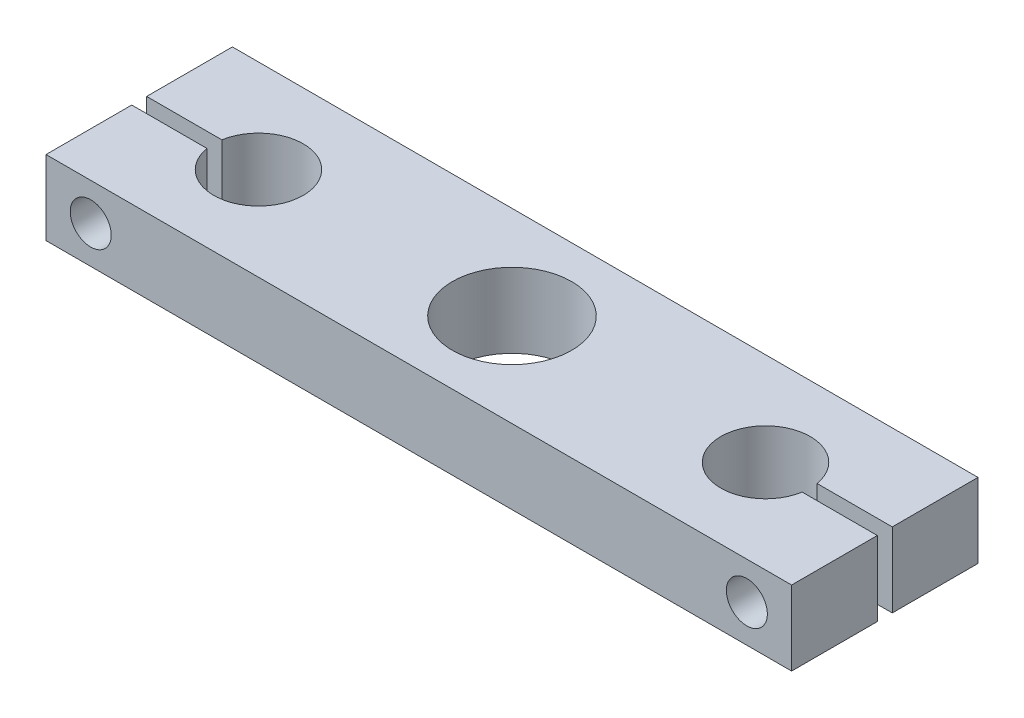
ISO-10303-21;
HEADER;
FILE_DESCRIPTION(('STEP AP214'),'2;1');
FILE_NAME('part.step','',(''),(''),'','','');
FILE_SCHEMA(('AUTOMOTIVE_DESIGN { 1 0 10303 214 1 1 1 1 }'));
ENDSEC;
DATA;
#1=APPLICATION_CONTEXT('core data for automotive mechanical design processes');
#2=APPLICATION_PROTOCOL_DEFINITION('international standard','automotive_design',2000,#1);
#3=PRODUCT_CONTEXT('',#1,'mechanical');
#4=PRODUCT('Part','Part','',(#3));
#5=PRODUCT_RELATED_PRODUCT_CATEGORY('part','',(#4));
#6=PRODUCT_DEFINITION_FORMATION('','',#4);
#7=PRODUCT_DEFINITION_CONTEXT('part definition',#1,'design');
#8=PRODUCT_DEFINITION('design','',#6,#7);
#9=PRODUCT_DEFINITION_SHAPE('','',#8);
#10=(LENGTH_UNIT() NAMED_UNIT(*) SI_UNIT(.MILLI.,.METRE.));
#11=(NAMED_UNIT(*) PLANE_ANGLE_UNIT() SI_UNIT($,.RADIAN.));
#12=(NAMED_UNIT(*) SI_UNIT($,.STERADIAN.) SOLID_ANGLE_UNIT());
#13=UNCERTAINTY_MEASURE_WITH_UNIT(LENGTH_MEASURE(1.E-05),#10,'distance_accuracy_value','');
#14=(GEOMETRIC_REPRESENTATION_CONTEXT(3) GLOBAL_UNCERTAINTY_ASSIGNED_CONTEXT((#13)) GLOBAL_UNIT_ASSIGNED_CONTEXT((#10,
#11,#12)) REPRESENTATION_CONTEXT('',''));
#15=CARTESIAN_POINT('',(0.,0.,0.));
#16=DIRECTION('',(0.,0.,1.));
#17=DIRECTION('',(1.,0.,0.));
#18=AXIS2_PLACEMENT_3D('',#15,#16,#17);
#19=CARTESIAN_POINT('',(44.,5.,-6.77817459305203));
#20=DIRECTION('',(0.,0.,1.));
#21=DIRECTION('',(1.,0.,0.));
#22=AXIS2_PLACEMENT_3D('',#19,#20,#21);
#23=CYLINDRICAL_SURFACE('',#22,2.75);
#24=CARTESIAN_POINT('',(44.,5.,1.));
#25=DIRECTION('',(0.,0.,1.));
#26=DIRECTION('',(1.,0.,0.));
#27=AXIS2_PLACEMENT_3D('',#24,#25,#26);
#28=CIRCLE('',#27,2.75);
#29=CARTESIAN_POINT('',(46.75,5.,1.));
#30=VERTEX_POINT('',#29);
#31=EDGE_CURVE('E115',#30,#30,#28,.F.);
#32=ORIENTED_EDGE('',*,*,#31,.T.);
#33=EDGE_LOOP('',(#32));
#34=FACE_BOUND('',#33,.T.);
#35=CARTESIAN_POINT('',(44.,5.,12.5));
#36=DIRECTION('',(0.,0.,1.));
#37=DIRECTION('',(1.,0.,0.));
#38=AXIS2_PLACEMENT_3D('',#35,#36,#37);
#39=CIRCLE('',#38,2.75);
#40=CARTESIAN_POINT('',(46.75,5.,12.5));
#41=VERTEX_POINT('',#40);
#42=EDGE_CURVE('E218',#41,#41,#39,.T.);
#43=ORIENTED_EDGE('',*,*,#42,.T.);
#44=EDGE_LOOP('',(#43));
#45=FACE_BOUND('',#44,.T.);
#46=ADVANCED_FACE('F17',(#34,#45),#23,.F.);
#47=CARTESIAN_POINT('',(-44.,5.,-6.77817459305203));
#48=DIRECTION('',(0.,0.,1.));
#49=DIRECTION('',(1.,0.,0.));
#50=AXIS2_PLACEMENT_3D('',#47,#48,#49);
#51=CYLINDRICAL_SURFACE('',#50,2.75);
#52=CARTESIAN_POINT('',(-44.,5.,12.5));
#53=DIRECTION('',(0.,0.,1.));
#54=DIRECTION('',(1.,0.,0.));
#55=AXIS2_PLACEMENT_3D('',#52,#53,#54);
#56=CIRCLE('',#55,2.75);
#57=CARTESIAN_POINT('',(-41.25,5.,12.5));
#58=VERTEX_POINT('',#57);
#59=EDGE_CURVE('E185',#58,#58,#56,.T.);
#60=ORIENTED_EDGE('',*,*,#59,.T.);
#61=EDGE_LOOP('',(#60));
#62=FACE_BOUND('',#61,.T.);
#63=CARTESIAN_POINT('',(-44.,5.,1.));
#64=DIRECTION('',(0.,0.,1.));
#65=DIRECTION('',(1.,0.,0.));
#66=AXIS2_PLACEMENT_3D('',#63,#64,#65);
#67=CIRCLE('',#66,2.75);
#68=CARTESIAN_POINT('',(-41.25,5.,1.));
#69=VERTEX_POINT('',#68);
#70=EDGE_CURVE('E178',#69,#69,#67,.F.);
#71=ORIENTED_EDGE('',*,*,#70,.T.);
#72=EDGE_LOOP('',(#71));
#73=FACE_BOUND('',#72,.T.);
#74=ADVANCED_FACE('F290',(#62,#73),#51,.F.);
#75=CARTESIAN_POINT('',(-44.,5.,12.5));
#76=DIRECTION('',(0.,0.,1.));
#77=DIRECTION('',(1.,0.,0.));
#78=AXIS2_PLACEMENT_3D('',#75,#76,#77);
#79=CYLINDRICAL_SURFACE('',#78,2.09999999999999);
#80=CARTESIAN_POINT('',(-44.,5.,-12.5));
#81=DIRECTION('',(0.,0.,1.));
#82=DIRECTION('',(1.,0.,0.));
#83=AXIS2_PLACEMENT_3D('',#80,#81,#82);
#84=CIRCLE('',#83,2.09999999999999);
#85=CARTESIAN_POINT('',(-41.9,5.,-12.5));
#86=VERTEX_POINT('',#85);
#87=EDGE_CURVE('E207',#86,#86,#84,.F.);
#88=ORIENTED_EDGE('',*,*,#87,.T.);
#89=EDGE_LOOP('',(#88));
#90=FACE_BOUND('',#89,.T.);
#91=CARTESIAN_POINT('',(-44.,5.,-1.));
#92=DIRECTION('',(0.,0.,1.));
#93=DIRECTION('',(1.,0.,0.));
#94=AXIS2_PLACEMENT_3D('',#91,#92,#93);
#95=CIRCLE('',#94,2.09999999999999);
#96=CARTESIAN_POINT('',(-41.9,5.,-1.));
#97=VERTEX_POINT('',#96);
#98=EDGE_CURVE('E151',#97,#97,#95,.T.);
#99=ORIENTED_EDGE('',*,*,#98,.T.);
#100=EDGE_LOOP('',(#99));
#101=FACE_BOUND('',#100,.T.);
#102=ADVANCED_FACE('F294',(#90,#101),#79,.F.);
#103=CARTESIAN_POINT('',(44.,5.,12.5));
#104=DIRECTION('',(0.,0.,1.));
#105=DIRECTION('',(1.,0.,0.));
#106=AXIS2_PLACEMENT_3D('',#103,#104,#105);
#107=CYLINDRICAL_SURFACE('',#106,2.09999999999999);
#108=CARTESIAN_POINT('',(44.,5.,-12.5));
#109=DIRECTION('',(0.,0.,1.));
#110=DIRECTION('',(1.,0.,0.));
#111=AXIS2_PLACEMENT_3D('',#108,#109,#110);
#112=CIRCLE('',#111,2.09999999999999);
#113=CARTESIAN_POINT('',(46.1,5.,-12.5));
#114=VERTEX_POINT('',#113);
#115=EDGE_CURVE('E162',#114,#114,#112,.F.);
#116=ORIENTED_EDGE('',*,*,#115,.T.);
#117=EDGE_LOOP('',(#116));
#118=FACE_BOUND('',#117,.T.);
#119=CARTESIAN_POINT('',(44.,5.,-1.));
#120=DIRECTION('',(0.,0.,1.));
#121=DIRECTION('',(1.,0.,0.));
#122=AXIS2_PLACEMENT_3D('',#119,#120,#121);
#123=CIRCLE('',#122,2.09999999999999);
#124=CARTESIAN_POINT('',(46.1,5.,-1.));
#125=VERTEX_POINT('',#124);
#126=EDGE_CURVE('E20',#125,#125,#123,.T.);
#127=ORIENTED_EDGE('',*,*,#126,.T.);
#128=EDGE_LOOP('',(#127));
#129=FACE_BOUND('',#128,.T.);
#130=ADVANCED_FACE('F299',(#118,#129),#107,.F.);
#131=CARTESIAN_POINT('',(0.,10.,0.));
#132=DIRECTION('',(0.,-1.,0.));
#133=DIRECTION('',(0.,0.,-1.));
#134=AXIS2_PLACEMENT_3D('',#131,#132,#133);
#135=PLANE('',#134);
#136=CARTESIAN_POINT('',(0.,10.,0.));
#137=DIRECTION('',(0.,-1.,0.));
#138=DIRECTION('',(0.,0.,-1.));
#139=AXIS2_PLACEMENT_3D('',#136,#137,#138);
#140=CIRCLE('',#139,8.);
#141=CARTESIAN_POINT('',(0.,10.,-8.));
#142=VERTEX_POINT('',#141);
#143=EDGE_CURVE('E145',#142,#142,#140,.T.);
#144=ORIENTED_EDGE('',*,*,#143,.T.);
#145=EDGE_LOOP('',(#144));
#146=FACE_BOUND('',#145,.T.);
#147=DIRECTION('',(-1.,0.,0.));
#148=VECTOR('',#147,1.);
#149=CARTESIAN_POINT('',(63.3755844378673,10.,-1.));
#150=LINE('',#149,#148);
#151=CARTESIAN_POINT('',(39.9160797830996,10.,-1.));
#152=VERTEX_POINT('',#151);
#153=CARTESIAN_POINT('',(50.,10.,-1.));
#154=VERTEX_POINT('',#153);
#155=EDGE_CURVE('E109',#152,#154,#150,.F.);
#156=ORIENTED_EDGE('',*,*,#155,.T.);
#157=DIRECTION('',(0.,0.,1.));
#158=VECTOR('',#157,1.);
#159=CARTESIAN_POINT('',(50.,10.,12.5));
#160=LINE('',#159,#158);
#161=CARTESIAN_POINT('',(50.,10.,-12.5));
#162=VERTEX_POINT('',#161);
#163=EDGE_CURVE('E134',#154,#162,#160,.F.);
#164=ORIENTED_EDGE('',*,*,#163,.T.);
#165=DIRECTION('',(1.,0.,0.));
#166=VECTOR('',#165,1.);
#167=CARTESIAN_POINT('',(-50.,10.,-12.5));
#168=LINE('',#167,#166);
#169=CARTESIAN_POINT('',(-50.,10.,-12.5));
#170=VERTEX_POINT('',#169);
#171=EDGE_CURVE('E159',#162,#170,#168,.F.);
#172=ORIENTED_EDGE('',*,*,#171,.T.);
#173=DIRECTION('',(0.,0.,-1.));
#174=VECTOR('',#173,1.);
#175=CARTESIAN_POINT('',(-50.,10.,12.5));
#176=LINE('',#175,#174);
#177=CARTESIAN_POINT('',(-50.,10.,-1.));
#178=VERTEX_POINT('',#177);
#179=EDGE_CURVE('E154',#170,#178,#176,.F.);
#180=ORIENTED_EDGE('',*,*,#179,.T.);
#181=DIRECTION('',(-1.,0.,0.));
#182=VECTOR('',#181,1.);
#183=CARTESIAN_POINT('',(-61.7514418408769,10.,-1.));
#184=LINE('',#183,#182);
#185=CARTESIAN_POINT('',(-39.9160797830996,10.,-1.));
#186=VERTEX_POINT('',#185);
#187=EDGE_CURVE('E148',#178,#186,#184,.F.);
#188=ORIENTED_EDGE('',*,*,#187,.T.);
#189=CARTESIAN_POINT('',(-34.,10.,0.));
#190=DIRECTION('',(0.,1.,0.));
#191=DIRECTION('',(0.,0.,1.));
#192=AXIS2_PLACEMENT_3D('',#189,#190,#191);
#193=CIRCLE('',#192,5.99999999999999);
#194=CARTESIAN_POINT('',(-39.9160797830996,10.,1.));
#195=VERTEX_POINT('',#194);
#196=EDGE_CURVE('E212',#186,#195,#193,.F.);
#197=ORIENTED_EDGE('',*,*,#196,.T.);
#198=DIRECTION('',(1.,0.,0.));
#199=VECTOR('',#198,1.);
#200=CARTESIAN_POINT('',(-61.7514418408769,10.,1.));
#201=LINE('',#200,#199);
#202=CARTESIAN_POINT('',(-50.,10.,1.));
#203=VERTEX_POINT('',#202);
#204=EDGE_CURVE('E168',#195,#203,#201,.F.);
#205=ORIENTED_EDGE('',*,*,#204,.T.);
#206=DIRECTION('',(0.,0.,-1.));
#207=VECTOR('',#206,1.);
#208=CARTESIAN_POINT('',(-50.,10.,12.5));
#209=LINE('',#208,#207);
#210=CARTESIAN_POINT('',(-50.,10.,12.5));
#211=VERTEX_POINT('',#210);
#212=EDGE_CURVE('E175',#203,#211,#209,.F.);
#213=ORIENTED_EDGE('',*,*,#212,.T.);
#214=DIRECTION('',(-1.,0.,0.));
#215=VECTOR('',#214,1.);
#216=CARTESIAN_POINT('',(-50.,10.,12.5));
#217=LINE('',#216,#215);
#218=CARTESIAN_POINT('',(50.,10.,12.5));
#219=VERTEX_POINT('',#218);
#220=EDGE_CURVE('E182',#211,#219,#217,.F.);
#221=ORIENTED_EDGE('',*,*,#220,.T.);
#222=DIRECTION('',(0.,0.,1.));
#223=VECTOR('',#222,1.);
#224=CARTESIAN_POINT('',(50.,10.,12.5));
#225=LINE('',#224,#223);
#226=CARTESIAN_POINT('',(50.,10.,0.999999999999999));
#227=VERTEX_POINT('',#226);
#228=EDGE_CURVE('E188',#219,#227,#225,.F.);
#229=ORIENTED_EDGE('',*,*,#228,.T.);
#230=DIRECTION('',(1.,0.,0.));
#231=VECTOR('',#230,1.);
#232=CARTESIAN_POINT('',(63.3755844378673,10.,0.999999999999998));
#233=LINE('',#232,#231);
#234=CARTESIAN_POINT('',(39.9160797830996,10.,1.));
#235=VERTEX_POINT('',#234);
#236=EDGE_CURVE('E103',#227,#235,#233,.F.);
#237=ORIENTED_EDGE('',*,*,#236,.T.);
#238=CARTESIAN_POINT('',(34.,10.,0.));
#239=DIRECTION('',(0.,1.,0.));
#240=DIRECTION('',(0.,0.,1.));
#241=AXIS2_PLACEMENT_3D('',#238,#239,#240);
#242=CIRCLE('',#241,5.99999999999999);
#243=EDGE_CURVE('E105',#235,#152,#242,.F.);
#244=ORIENTED_EDGE('',*,*,#243,.T.);
#245=EDGE_LOOP('',(#156,#164,#172,#180,#188,#197,#205,#213,#221,#229,#237,#244));
#246=FACE_BOUND('',#245,.T.);
#247=ADVANCED_FACE('F107',(#146,#246),#135,.F.);
#248=CARTESIAN_POINT('',(63.3755844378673,0.,-1.));
#249=DIRECTION('',(0.,0.,-1.));
#250=DIRECTION('',(-1.,0.,0.));
#251=AXIS2_PLACEMENT_3D('',#248,#249,#250);
#252=PLANE('',#251);
#253=DIRECTION('',(0.,1.,0.));
#254=VECTOR('',#253,1.);
#255=CARTESIAN_POINT('',(39.9160797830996,0.,-1.));
#256=LINE('',#255,#254);
#257=CARTESIAN_POINT('',(39.9160797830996,0.,-1.));
#258=VERTEX_POINT('',#257);
#259=EDGE_CURVE('E116',#152,#258,#256,.F.);
#260=ORIENTED_EDGE('',*,*,#259,.T.);
#261=DIRECTION('',(1.,0.,0.));
#262=VECTOR('',#261,1.);
#263=CARTESIAN_POINT('',(0.,0.,-1.));
#264=LINE('',#263,#262);
#265=CARTESIAN_POINT('',(50.,0.,-1.));
#266=VERTEX_POINT('',#265);
#267=EDGE_CURVE('E202',#266,#258,#264,.F.);
#268=ORIENTED_EDGE('',*,*,#267,.F.);
#269=DIRECTION('',(0.,1.,0.));
#270=VECTOR('',#269,1.);
#271=CARTESIAN_POINT('',(50.,10.,-1.));
#272=LINE('',#271,#270);
#273=EDGE_CURVE('E122',#266,#154,#272,.T.);
#274=ORIENTED_EDGE('',*,*,#273,.T.);
#275=ORIENTED_EDGE('',*,*,#155,.F.);
#276=EDGE_LOOP('',(#260,#268,#274,#275));
#277=FACE_BOUND('',#276,.T.);
#278=ORIENTED_EDGE('',*,*,#126,.F.);
#279=EDGE_LOOP('',(#278));
#280=FACE_BOUND('',#279,.T.);
#281=ADVANCED_FACE('F118',(#277,#280),#252,.F.);
#282=CARTESIAN_POINT('',(34.,0.,0.));
#283=DIRECTION('',(0.,1.,0.));
#284=DIRECTION('',(0.,0.,1.));
#285=AXIS2_PLACEMENT_3D('',#282,#283,#284);
#286=CYLINDRICAL_SURFACE('',#285,5.99999999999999);
#287=DIRECTION('',(0.,1.,0.));
#288=VECTOR('',#287,1.);
#289=CARTESIAN_POINT('',(39.9160797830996,0.,1.));
#290=LINE('',#289,#288);
#291=CARTESIAN_POINT('',(39.9160797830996,0.,1.));
#292=VERTEX_POINT('',#291);
#293=EDGE_CURVE('E131',#235,#292,#290,.F.);
#294=ORIENTED_EDGE('',*,*,#293,.T.);
#295=CARTESIAN_POINT('',(34.,0.,0.));
#296=DIRECTION('',(0.,1.,0.));
#297=DIRECTION('',(0.,0.,1.));
#298=AXIS2_PLACEMENT_3D('',#295,#296,#297);
#299=CIRCLE('',#298,5.99999999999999);
#300=EDGE_CURVE('E126',#258,#292,#299,.T.);
#301=ORIENTED_EDGE('',*,*,#300,.F.);
#302=ORIENTED_EDGE('',*,*,#259,.F.);
#303=ORIENTED_EDGE('',*,*,#243,.F.);
#304=EDGE_LOOP('',(#294,#301,#302,#303));
#305=FACE_BOUND('',#304,.T.);
#306=ADVANCED_FACE('F125',(#305),#286,.F.);
#307=CARTESIAN_POINT('',(63.3755844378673,0.,0.999999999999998));
#308=DIRECTION('',(0.,0.,1.));
#309=DIRECTION('',(1.,0.,0.));
#310=AXIS2_PLACEMENT_3D('',#307,#308,#309);
#311=PLANE('',#310);
#312=ORIENTED_EDGE('',*,*,#293,.F.);
#313=ORIENTED_EDGE('',*,*,#236,.F.);
#314=DIRECTION('',(0.,1.,0.));
#315=VECTOR('',#314,1.);
#316=CARTESIAN_POINT('',(50.,10.,0.999999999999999));
#317=LINE('',#316,#315);
#318=CARTESIAN_POINT('',(50.,0.,1.));
#319=VERTEX_POINT('',#318);
#320=EDGE_CURVE('E190',#227,#319,#317,.F.);
#321=ORIENTED_EDGE('',*,*,#320,.T.);
#322=DIRECTION('',(1.,0.,0.));
#323=VECTOR('',#322,1.);
#324=CARTESIAN_POINT('',(0.,0.,1.));
#325=LINE('',#324,#323);
#326=EDGE_CURVE('E201',#292,#319,#325,.T.);
#327=ORIENTED_EDGE('',*,*,#326,.F.);
#328=EDGE_LOOP('',(#312,#313,#321,#327));
#329=FACE_BOUND('',#328,.T.);
#330=ORIENTED_EDGE('',*,*,#31,.F.);
#331=EDGE_LOOP('',(#330));
#332=FACE_BOUND('',#331,.T.);
#333=ADVANCED_FACE('F226',(#329,#332),#311,.F.);
#334=CARTESIAN_POINT('',(50.,10.,12.5));
#335=DIRECTION('',(-1.,0.,0.));
#336=DIRECTION('',(0.,0.,1.));
#337=AXIS2_PLACEMENT_3D('',#334,#335,#336);
#338=PLANE('',#337);
#339=ORIENTED_EDGE('',*,*,#320,.F.);
#340=ORIENTED_EDGE('',*,*,#228,.F.);
#341=DIRECTION('',(0.,1.,0.));
#342=VECTOR('',#341,1.);
#343=CARTESIAN_POINT('',(50.,10.,12.5));
#344=LINE('',#343,#342);
#345=CARTESIAN_POINT('',(50.,0.,12.5));
#346=VERTEX_POINT('',#345);
#347=EDGE_CURVE('E184',#219,#346,#344,.F.);
#348=ORIENTED_EDGE('',*,*,#347,.T.);
#349=DIRECTION('',(0.,0.,-1.));
#350=VECTOR('',#349,1.);
#351=CARTESIAN_POINT('',(50.,0.,0.));
#352=LINE('',#351,#350);
#353=EDGE_CURVE('E450',#319,#346,#352,.F.);
#354=ORIENTED_EDGE('',*,*,#353,.F.);
#355=EDGE_LOOP('',(#339,#340,#348,#354));
#356=FACE_BOUND('',#355,.T.);
#357=ADVANCED_FACE('F228',(#356),#338,.F.);
#358=CARTESIAN_POINT('',(-50.,10.,12.5));
#359=DIRECTION('',(0.,0.,-1.));
#360=DIRECTION('',(-1.,0.,0.));
#361=AXIS2_PLACEMENT_3D('',#358,#359,#360);
#362=PLANE('',#361);
#363=ORIENTED_EDGE('',*,*,#347,.F.);
#364=ORIENTED_EDGE('',*,*,#220,.F.);
#365=DIRECTION('',(0.,1.,0.));
#366=VECTOR('',#365,1.);
#367=CARTESIAN_POINT('',(-50.,10.,12.5));
#368=LINE('',#367,#366);
#369=CARTESIAN_POINT('',(-50.,0.,12.5));
#370=VERTEX_POINT('',#369);
#371=EDGE_CURVE('E179',#211,#370,#368,.F.);
#372=ORIENTED_EDGE('',*,*,#371,.T.);
#373=DIRECTION('',(1.,0.,0.));
#374=VECTOR('',#373,1.);
#375=CARTESIAN_POINT('',(0.,0.,12.5));
#376=LINE('',#375,#374);
#377=EDGE_CURVE('E438',#346,#370,#376,.F.);
#378=ORIENTED_EDGE('',*,*,#377,.F.);
#379=EDGE_LOOP('',(#363,#364,#372,#378));
#380=FACE_BOUND('',#379,.T.);
#381=ORIENTED_EDGE('',*,*,#59,.F.);
#382=EDGE_LOOP('',(#381));
#383=FACE_BOUND('',#382,.T.);
#384=ORIENTED_EDGE('',*,*,#42,.F.);
#385=EDGE_LOOP('',(#384));
#386=FACE_BOUND('',#385,.T.);
#387=ADVANCED_FACE('F236',(#380,#383,#386),#362,.F.);
#388=CARTESIAN_POINT('',(-50.,10.,12.5));
#389=DIRECTION('',(1.,0.,0.));
#390=DIRECTION('',(0.,0.,-1.));
#391=AXIS2_PLACEMENT_3D('',#388,#389,#390);
#392=PLANE('',#391);
#393=DIRECTION('',(0.,1.,0.));
#394=VECTOR('',#393,1.);
#395=CARTESIAN_POINT('',(-50.,0.,1.));
#396=LINE('',#395,#394);
#397=CARTESIAN_POINT('',(-50.,0.,1.));
#398=VERTEX_POINT('',#397);
#399=EDGE_CURVE('E172',#203,#398,#396,.F.);
#400=ORIENTED_EDGE('',*,*,#399,.T.);
#401=DIRECTION('',(0.,0.,-1.));
#402=VECTOR('',#401,1.);
#403=CARTESIAN_POINT('',(-50.,0.,0.));
#404=LINE('',#403,#402);
#405=EDGE_CURVE('E484',#370,#398,#404,.T.);
#406=ORIENTED_EDGE('',*,*,#405,.F.);
#407=ORIENTED_EDGE('',*,*,#371,.F.);
#408=ORIENTED_EDGE('',*,*,#212,.F.);
#409=EDGE_LOOP('',(#400,#406,#407,#408));
#410=FACE_BOUND('',#409,.T.);
#411=ADVANCED_FACE('F274',(#410),#392,.F.);
#412=CARTESIAN_POINT('',(-61.7514418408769,0.,1.));
#413=DIRECTION('',(0.,0.,1.));
#414=DIRECTION('',(1.,0.,0.));
#415=AXIS2_PLACEMENT_3D('',#412,#413,#414);
#416=PLANE('',#415);
#417=DIRECTION('',(0.,1.,0.));
#418=VECTOR('',#417,1.);
#419=CARTESIAN_POINT('',(-39.9160797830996,0.,1.));
#420=LINE('',#419,#418);
#421=CARTESIAN_POINT('',(-39.9160797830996,0.,1.));
#422=VERTEX_POINT('',#421);
#423=EDGE_CURVE('E171',#195,#422,#420,.F.);
#424=ORIENTED_EDGE('',*,*,#423,.T.);
#425=DIRECTION('',(1.,0.,0.));
#426=VECTOR('',#425,1.);
#427=CARTESIAN_POINT('',(0.,0.,1.));
#428=LINE('',#427,#426);
#429=EDGE_CURVE('E199',#398,#422,#428,.T.);
#430=ORIENTED_EDGE('',*,*,#429,.F.);
#431=ORIENTED_EDGE('',*,*,#399,.F.);
#432=ORIENTED_EDGE('',*,*,#204,.F.);
#433=EDGE_LOOP('',(#424,#430,#431,#432));
#434=FACE_BOUND('',#433,.T.);
#435=ORIENTED_EDGE('',*,*,#70,.F.);
#436=EDGE_LOOP('',(#435));
#437=FACE_BOUND('',#436,.T.);
#438=ADVANCED_FACE('F270',(#434,#437),#416,.F.);
#439=CARTESIAN_POINT('',(-34.,0.,0.));
#440=DIRECTION('',(0.,1.,0.));
#441=DIRECTION('',(0.,0.,1.));
#442=AXIS2_PLACEMENT_3D('',#439,#440,#441);
#443=CYLINDRICAL_SURFACE('',#442,5.99999999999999);
#444=DIRECTION('',(0.,1.,0.));
#445=VECTOR('',#444,1.);
#446=CARTESIAN_POINT('',(-39.9160797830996,0.,-1.));
#447=LINE('',#446,#445);
#448=CARTESIAN_POINT('',(-39.9160797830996,0.,-1.));
#449=VERTEX_POINT('',#448);
#450=EDGE_CURVE('E150',#186,#449,#447,.F.);
#451=ORIENTED_EDGE('',*,*,#450,.T.);
#452=CARTESIAN_POINT('',(-34.,0.,0.));
#453=DIRECTION('',(0.,1.,0.));
#454=DIRECTION('',(0.,0.,1.));
#455=AXIS2_PLACEMENT_3D('',#452,#453,#454);
#456=CIRCLE('',#455,5.99999999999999);
#457=EDGE_CURVE('E196',#422,#449,#456,.T.);
#458=ORIENTED_EDGE('',*,*,#457,.F.);
#459=ORIENTED_EDGE('',*,*,#423,.F.);
#460=ORIENTED_EDGE('',*,*,#196,.F.);
#461=EDGE_LOOP('',(#451,#458,#459,#460));
#462=FACE_BOUND('',#461,.T.);
#463=ADVANCED_FACE('F266',(#462),#443,.F.);
#464=CARTESIAN_POINT('',(-61.7514418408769,0.,-1.));
#465=DIRECTION('',(0.,0.,-1.));
#466=DIRECTION('',(-1.,0.,0.));
#467=AXIS2_PLACEMENT_3D('',#464,#465,#466);
#468=PLANE('',#467);
#469=ORIENTED_EDGE('',*,*,#450,.F.);
#470=ORIENTED_EDGE('',*,*,#187,.F.);
#471=DIRECTION('',(0.,1.,0.));
#472=VECTOR('',#471,1.);
#473=CARTESIAN_POINT('',(-50.,10.,-1.));
#474=LINE('',#473,#472);
#475=CARTESIAN_POINT('',(-50.,0.,-1.));
#476=VERTEX_POINT('',#475);
#477=EDGE_CURVE('E156',#178,#476,#474,.F.);
#478=ORIENTED_EDGE('',*,*,#477,.T.);
#479=DIRECTION('',(1.,0.,0.));
#480=VECTOR('',#479,1.);
#481=CARTESIAN_POINT('',(0.,0.,-1.));
#482=LINE('',#481,#480);
#483=EDGE_CURVE('E198',#449,#476,#482,.F.);
#484=ORIENTED_EDGE('',*,*,#483,.F.);
#485=EDGE_LOOP('',(#469,#470,#478,#484));
#486=FACE_BOUND('',#485,.T.);
#487=ORIENTED_EDGE('',*,*,#98,.F.);
#488=EDGE_LOOP('',(#487));
#489=FACE_BOUND('',#488,.T.);
#490=ADVANCED_FACE('F262',(#486,#489),#468,.F.);
#491=CARTESIAN_POINT('',(-50.,10.,12.5));
#492=DIRECTION('',(1.,0.,0.));
#493=DIRECTION('',(0.,0.,-1.));
#494=AXIS2_PLACEMENT_3D('',#491,#492,#493);
#495=PLANE('',#494);
#496=ORIENTED_EDGE('',*,*,#477,.F.);
#497=ORIENTED_EDGE('',*,*,#179,.F.);
#498=DIRECTION('',(0.,1.,0.));
#499=VECTOR('',#498,1.);
#500=CARTESIAN_POINT('',(-50.,10.,-12.5));
#501=LINE('',#500,#499);
#502=CARTESIAN_POINT('',(-50.,0.,-12.5));
#503=VERTEX_POINT('',#502);
#504=EDGE_CURVE('E161',#170,#503,#501,.F.);
#505=ORIENTED_EDGE('',*,*,#504,.T.);
#506=DIRECTION('',(0.,0.,-1.));
#507=VECTOR('',#506,1.);
#508=CARTESIAN_POINT('',(-50.,0.,0.));
#509=LINE('',#508,#507);
#510=EDGE_CURVE('E472',#476,#503,#509,.T.);
#511=ORIENTED_EDGE('',*,*,#510,.F.);
#512=EDGE_LOOP('',(#496,#497,#505,#511));
#513=FACE_BOUND('',#512,.T.);
#514=ADVANCED_FACE('F259',(#513),#495,.F.);
#515=CARTESIAN_POINT('',(-50.,10.,-12.5));
#516=DIRECTION('',(0.,0.,1.));
#517=DIRECTION('',(1.,0.,0.));
#518=AXIS2_PLACEMENT_3D('',#515,#516,#517);
#519=PLANE('',#518);
#520=ORIENTED_EDGE('',*,*,#504,.F.);
#521=ORIENTED_EDGE('',*,*,#171,.F.);
#522=DIRECTION('',(0.,1.,0.));
#523=VECTOR('',#522,1.);
#524=CARTESIAN_POINT('',(50.,10.,-12.5));
#525=LINE('',#524,#523);
#526=CARTESIAN_POINT('',(50.,0.,-12.5));
#527=VERTEX_POINT('',#526);
#528=EDGE_CURVE('E35',#162,#527,#525,.F.);
#529=ORIENTED_EDGE('',*,*,#528,.T.);
#530=DIRECTION('',(1.,0.,0.));
#531=VECTOR('',#530,1.);
#532=CARTESIAN_POINT('',(0.,0.,-12.5));
#533=LINE('',#532,#531);
#534=EDGE_CURVE('E139',#503,#527,#533,.T.);
#535=ORIENTED_EDGE('',*,*,#534,.F.);
#536=EDGE_LOOP('',(#520,#521,#529,#535));
#537=FACE_BOUND('',#536,.T.);
#538=ORIENTED_EDGE('',*,*,#115,.F.);
#539=EDGE_LOOP('',(#538));
#540=FACE_BOUND('',#539,.T.);
#541=ORIENTED_EDGE('',*,*,#87,.F.);
#542=EDGE_LOOP('',(#541));
#543=FACE_BOUND('',#542,.T.);
#544=ADVANCED_FACE('F255',(#537,#540,#543),#519,.F.);
#545=CARTESIAN_POINT('',(50.,10.,12.5));
#546=DIRECTION('',(-1.,0.,0.));
#547=DIRECTION('',(0.,0.,1.));
#548=AXIS2_PLACEMENT_3D('',#545,#546,#547);
#549=PLANE('',#548);
#550=ORIENTED_EDGE('',*,*,#273,.F.);
#551=DIRECTION('',(0.,0.,-1.));
#552=VECTOR('',#551,1.);
#553=CARTESIAN_POINT('',(50.,0.,0.));
#554=LINE('',#553,#552);
#555=EDGE_CURVE('E26',#527,#266,#554,.F.);
#556=ORIENTED_EDGE('',*,*,#555,.F.);
#557=ORIENTED_EDGE('',*,*,#528,.F.);
#558=ORIENTED_EDGE('',*,*,#163,.F.);
#559=EDGE_LOOP('',(#550,#556,#557,#558));
#560=FACE_BOUND('',#559,.T.);
#561=ADVANCED_FACE('F248',(#560),#549,.F.);
#562=CARTESIAN_POINT('',(0.,10.,0.));
#563=DIRECTION('',(0.,-1.,0.));
#564=DIRECTION('',(0.,0.,-1.));
#565=AXIS2_PLACEMENT_3D('',#562,#563,#564);
#566=CYLINDRICAL_SURFACE('',#565,8.);
#567=ORIENTED_EDGE('',*,*,#143,.F.);
#568=EDGE_LOOP('',(#567));
#569=FACE_BOUND('',#568,.T.);
#570=CARTESIAN_POINT('',(0.,0.,0.));
#571=DIRECTION('',(0.,-1.,0.));
#572=DIRECTION('',(0.,0.,-1.));
#573=AXIS2_PLACEMENT_3D('',#570,#571,#572);
#574=CIRCLE('',#573,8.);
#575=CARTESIAN_POINT('',(0.,0.,-8.));
#576=VERTEX_POINT('',#575);
#577=EDGE_CURVE('E11',#576,#576,#574,.F.);
#578=ORIENTED_EDGE('',*,*,#577,.F.);
#579=EDGE_LOOP('',(#578));
#580=FACE_BOUND('',#579,.T.);
#581=ADVANCED_FACE('F242',(#569,#580),#566,.F.);
#582=CARTESIAN_POINT('',(0.,0.,0.));
#583=DIRECTION('',(0.,-1.,0.));
#584=DIRECTION('',(0.,0.,-1.));
#585=AXIS2_PLACEMENT_3D('',#582,#583,#584);
#586=PLANE('',#585);
#587=ORIENTED_EDGE('',*,*,#577,.T.);
#588=EDGE_LOOP('',(#587));
#589=FACE_BOUND('',#588,.T.);
#590=ORIENTED_EDGE('',*,*,#534,.T.);
#591=ORIENTED_EDGE('',*,*,#555,.T.);
#592=ORIENTED_EDGE('',*,*,#267,.T.);
#593=ORIENTED_EDGE('',*,*,#300,.T.);
#594=ORIENTED_EDGE('',*,*,#326,.T.);
#595=ORIENTED_EDGE('',*,*,#353,.T.);
#596=ORIENTED_EDGE('',*,*,#377,.T.);
#597=ORIENTED_EDGE('',*,*,#405,.T.);
#598=ORIENTED_EDGE('',*,*,#429,.T.);
#599=ORIENTED_EDGE('',*,*,#457,.T.);
#600=ORIENTED_EDGE('',*,*,#483,.T.);
#601=ORIENTED_EDGE('',*,*,#510,.T.);
#602=EDGE_LOOP('',(#590,#591,#592,#593,#594,#595,#596,#597,#598,#599,#600,#601));
#603=FACE_BOUND('',#602,.T.);
#604=ADVANCED_FACE('F240',(#589,#603),#586,.T.);
#605=CLOSED_SHELL('',(#46,#74,#102,#130,#247,#281,#306,#333,#357,#387,#411,#438,#463,#490,#514,
#544,#561,#581,#604));
#606=MANIFOLD_SOLID_BREP('B1',#605);
#607=ADVANCED_BREP_SHAPE_REPRESENTATION('',(#18,#606),#14);
#608=SHAPE_DEFINITION_REPRESENTATION(#9,#607);
ENDSEC;
END-ISO-10303-21;
